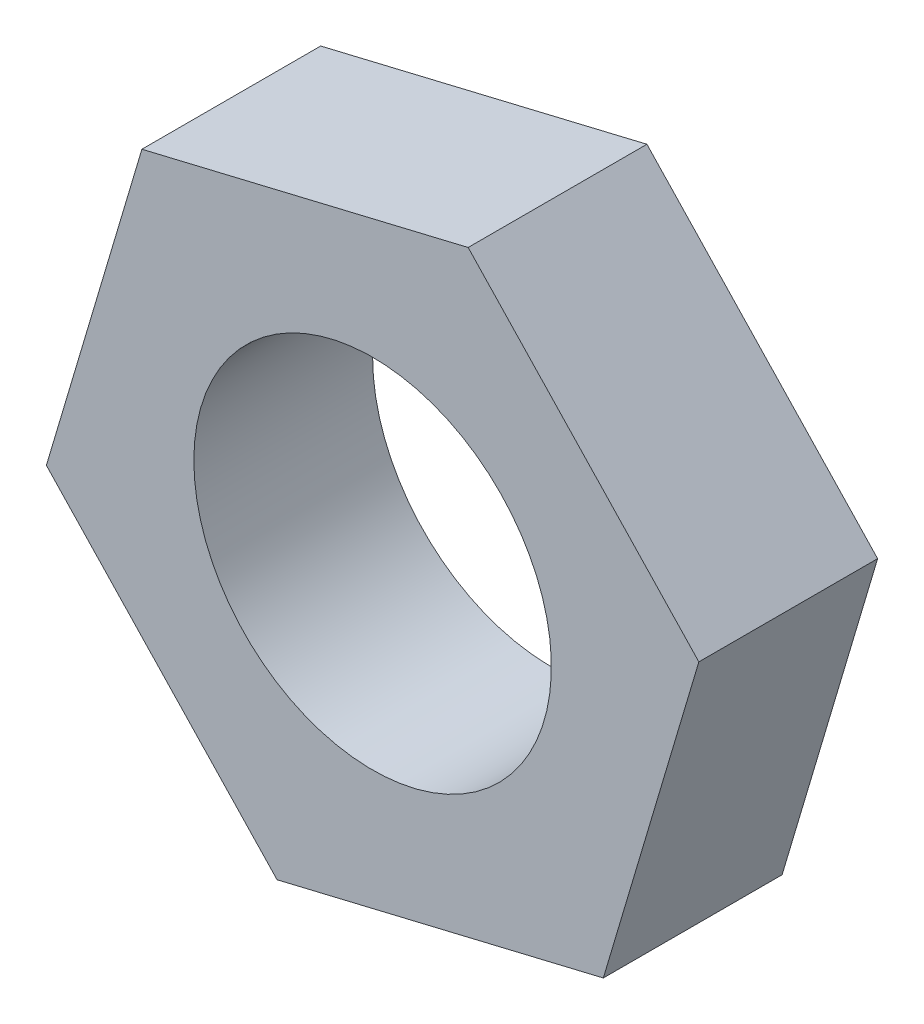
ISO-10303-21;
HEADER;
FILE_DESCRIPTION(('STEP AP214'),'2;1');
FILE_NAME('part.step','',(''),(''),'','','');
FILE_SCHEMA(('AUTOMOTIVE_DESIGN { 1 0 10303 214 1 1 1 1 }'));
ENDSEC;
DATA;
#1=APPLICATION_CONTEXT('core data for automotive mechanical design processes');
#2=APPLICATION_PROTOCOL_DEFINITION('international standard','automotive_design',2000,#1);
#3=PRODUCT_CONTEXT('',#1,'mechanical');
#4=PRODUCT('Part','Part','',(#3));
#5=PRODUCT_RELATED_PRODUCT_CATEGORY('part','',(#4));
#6=PRODUCT_DEFINITION_FORMATION('','',#4);
#7=PRODUCT_DEFINITION_CONTEXT('part definition',#1,'design');
#8=PRODUCT_DEFINITION('design','',#6,#7);
#9=PRODUCT_DEFINITION_SHAPE('','',#8);
#10=(LENGTH_UNIT() NAMED_UNIT(*) SI_UNIT(.MILLI.,.METRE.));
#11=(NAMED_UNIT(*) PLANE_ANGLE_UNIT() SI_UNIT($,.RADIAN.));
#12=(NAMED_UNIT(*) SI_UNIT($,.STERADIAN.) SOLID_ANGLE_UNIT());
#13=UNCERTAINTY_MEASURE_WITH_UNIT(LENGTH_MEASURE(1.E-05),#10,'distance_accuracy_value','');
#14=(GEOMETRIC_REPRESENTATION_CONTEXT(3) GLOBAL_UNCERTAINTY_ASSIGNED_CONTEXT((#13)) GLOBAL_UNIT_ASSIGNED_CONTEXT((#10,
#11,#12)) REPRESENTATION_CONTEXT('',''));
#15=CARTESIAN_POINT('',(0.,0.,0.));
#16=DIRECTION('',(0.,0.,1.));
#17=DIRECTION('',(1.,0.,0.));
#18=AXIS2_PLACEMENT_3D('',#15,#16,#17);
#19=CARTESIAN_POINT('',(0.,0.,0.));
#20=DIRECTION('',(0.,0.,1.));
#21=DIRECTION('',(1.,0.,0.));
#22=AXIS2_PLACEMENT_3D('',#19,#20,#21);
#23=PLANE('',#22);
#24=CARTESIAN_POINT('',(-24.6838750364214,9.40791708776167,0.));
#25=DIRECTION('',(0.,0.,-1.));
#26=DIRECTION('',(-1.,0.,0.));
#27=AXIS2_PLACEMENT_3D('',#24,#25,#26);
#28=CIRCLE('',#27,4.);
#29=CARTESIAN_POINT('',(-28.6838750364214,9.40791708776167,0.));
#30=VERTEX_POINT('',#29);
#31=EDGE_CURVE('E19',#30,#30,#28,.F.);
#32=ORIENTED_EDGE('',*,*,#31,.T.);
#33=EDGE_LOOP('',(#32));
#34=FACE_BOUND('',#33,.T.);
#35=DIRECTION('',(-0.687744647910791,0.72595268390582,0.));
#36=VECTOR('',#35,1.);
#37=CARTESIAN_POINT('',(-31.9835196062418,7.66191522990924,0.));
#38=LINE('',#37,#36);
#39=CARTESIAN_POINT('',(-26.8216153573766,2.21323852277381,0.));
#40=VERTEX_POINT('',#39);
#41=CARTESIAN_POINT('',(-31.9835196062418,7.66191522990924,0.));
#42=VERTEX_POINT('',#41);
#43=EDGE_CURVE('E104',#40,#42,#38,.T.);
#44=ORIENTED_EDGE('',*,*,#43,.T.);
#45=DIRECTION('',(0.284821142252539,0.958580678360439,0.));
#46=VECTOR('',#45,1.);
#47=CARTESIAN_POINT('',(-29.8457792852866,14.8565937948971,0.));
#48=LINE('',#47,#46);
#49=CARTESIAN_POINT('',(-29.8457792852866,14.8565937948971,0.));
#50=VERTEX_POINT('',#49);
#51=EDGE_CURVE('E99',#42,#50,#48,.T.);
#52=ORIENTED_EDGE('',*,*,#51,.T.);
#53=DIRECTION('',(0.97256579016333,0.232627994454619,0.));
#54=VECTOR('',#53,1.);
#55=CARTESIAN_POINT('',(-22.5461347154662,16.6025956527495,0.));
#56=LINE('',#55,#54);
#57=CARTESIAN_POINT('',(-22.5461347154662,16.6025956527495,0.));
#58=VERTEX_POINT('',#57);
#59=EDGE_CURVE('E95',#50,#58,#56,.T.);
#60=ORIENTED_EDGE('',*,*,#59,.T.);
#61=DIRECTION('',(0.687744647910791,-0.725952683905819,0.));
#62=VECTOR('',#61,1.);
#63=CARTESIAN_POINT('',(-17.3842304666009,11.1539189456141,0.));
#64=LINE('',#63,#62);
#65=CARTESIAN_POINT('',(-17.3842304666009,11.1539189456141,0.));
#66=VERTEX_POINT('',#65);
#67=EDGE_CURVE('E81',#58,#66,#64,.T.);
#68=ORIENTED_EDGE('',*,*,#67,.T.);
#69=DIRECTION('',(-0.28482114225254,-0.958580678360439,0.));
#70=VECTOR('',#69,1.);
#71=CARTESIAN_POINT('',(-19.5219707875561,3.95924038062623,0.));
#72=LINE('',#71,#70);
#73=CARTESIAN_POINT('',(-19.5219707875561,3.95924038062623,0.));
#74=VERTEX_POINT('',#73);
#75=EDGE_CURVE('E65',#66,#74,#72,.T.);
#76=ORIENTED_EDGE('',*,*,#75,.T.);
#77=DIRECTION('',(-0.97256579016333,-0.232627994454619,0.));
#78=VECTOR('',#77,1.);
#79=CARTESIAN_POINT('',(-26.8216153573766,2.21323852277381,0.));
#80=LINE('',#79,#78);
#81=EDGE_CURVE('E70',#74,#40,#80,.T.);
#82=ORIENTED_EDGE('',*,*,#81,.T.);
#83=EDGE_LOOP('',(#44,#52,#60,#68,#76,#82));
#84=FACE_BOUND('',#83,.T.);
#85=ADVANCED_FACE('F16',(#34,#84),#23,.F.);
#86=CARTESIAN_POINT('',(-26.8216153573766,2.21323852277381,4.));
#87=DIRECTION('',(-0.232627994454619,0.97256579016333,0.));
#88=DIRECTION('',(-0.97256579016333,-0.232627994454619,0.));
#89=AXIS2_PLACEMENT_3D('',#86,#87,#88);
#90=PLANE('',#89);
#91=DIRECTION('',(0.,0.,1.));
#92=VECTOR('',#91,1.);
#93=CARTESIAN_POINT('',(-19.5219707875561,3.95924038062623,4.));
#94=LINE('',#93,#92);
#95=CARTESIAN_POINT('',(-19.5219707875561,3.95924038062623,4.));
#96=VERTEX_POINT('',#95);
#97=EDGE_CURVE('E72',#74,#96,#94,.T.);
#98=ORIENTED_EDGE('',*,*,#97,.T.);
#99=DIRECTION('',(0.97256579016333,0.232627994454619,0.));
#100=VECTOR('',#99,1.);
#101=CARTESIAN_POINT('',(-26.8216153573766,2.21323852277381,4.));
#102=LINE('',#101,#100);
#103=CARTESIAN_POINT('',(-26.8216153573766,2.21323852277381,4.));
#104=VERTEX_POINT('',#103);
#105=EDGE_CURVE('E106',#104,#96,#102,.T.);
#106=ORIENTED_EDGE('',*,*,#105,.F.);
#107=DIRECTION('',(0.,0.,1.));
#108=VECTOR('',#107,1.);
#109=CARTESIAN_POINT('',(-26.8216153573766,2.21323852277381,4.));
#110=LINE('',#109,#108);
#111=EDGE_CURVE('E75',#104,#40,#110,.F.);
#112=ORIENTED_EDGE('',*,*,#111,.T.);
#113=ORIENTED_EDGE('',*,*,#81,.F.);
#114=EDGE_LOOP('',(#98,#106,#112,#113));
#115=FACE_BOUND('',#114,.T.);
#116=ADVANCED_FACE('F71',(#115),#90,.F.);
#117=CARTESIAN_POINT('',(-19.5219707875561,3.95924038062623,4.));
#118=DIRECTION('',(-0.958580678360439,0.28482114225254,0.));
#119=DIRECTION('',(-0.28482114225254,-0.958580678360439,0.));
#120=AXIS2_PLACEMENT_3D('',#117,#118,#119);
#121=PLANE('',#120);
#122=DIRECTION('',(0.,0.,1.));
#123=VECTOR('',#122,1.);
#124=CARTESIAN_POINT('',(-17.3842304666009,11.1539189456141,4.));
#125=LINE('',#124,#123);
#126=CARTESIAN_POINT('',(-17.3842304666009,11.1539189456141,4.));
#127=VERTEX_POINT('',#126);
#128=EDGE_CURVE('E83',#66,#127,#125,.T.);
#129=ORIENTED_EDGE('',*,*,#128,.T.);
#130=DIRECTION('',(0.284821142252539,0.958580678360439,0.));
#131=VECTOR('',#130,1.);
#132=CARTESIAN_POINT('',(-19.5219707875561,3.95924038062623,4.));
#133=LINE('',#132,#131);
#134=EDGE_CURVE('E87',#96,#127,#133,.T.);
#135=ORIENTED_EDGE('',*,*,#134,.F.);
#136=ORIENTED_EDGE('',*,*,#97,.F.);
#137=ORIENTED_EDGE('',*,*,#75,.F.);
#138=EDGE_LOOP('',(#129,#135,#136,#137));
#139=FACE_BOUND('',#138,.T.);
#140=ADVANCED_FACE('F85',(#139),#121,.F.);
#141=CARTESIAN_POINT('',(-17.3842304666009,11.1539189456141,4.));
#142=DIRECTION('',(-0.725952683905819,-0.687744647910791,0.));
#143=DIRECTION('',(0.687744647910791,-0.725952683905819,0.));
#144=AXIS2_PLACEMENT_3D('',#141,#142,#143);
#145=PLANE('',#144);
#146=DIRECTION('',(0.,0.,1.));
#147=VECTOR('',#146,1.);
#148=CARTESIAN_POINT('',(-22.5461347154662,16.6025956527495,4.));
#149=LINE('',#148,#147);
#150=CARTESIAN_POINT('',(-22.5461347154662,16.6025956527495,4.));
#151=VERTEX_POINT('',#150);
#152=EDGE_CURVE('E93',#58,#151,#149,.T.);
#153=ORIENTED_EDGE('',*,*,#152,.T.);
#154=DIRECTION('',(-0.687744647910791,0.725952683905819,0.));
#155=VECTOR('',#154,1.);
#156=CARTESIAN_POINT('',(-17.3842304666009,11.1539189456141,4.));
#157=LINE('',#156,#155);
#158=EDGE_CURVE('E109',#127,#151,#157,.T.);
#159=ORIENTED_EDGE('',*,*,#158,.F.);
#160=ORIENTED_EDGE('',*,*,#128,.F.);
#161=ORIENTED_EDGE('',*,*,#67,.F.);
#162=EDGE_LOOP('',(#153,#159,#160,#161));
#163=FACE_BOUND('',#162,.T.);
#164=ADVANCED_FACE('F131',(#163),#145,.F.);
#165=CARTESIAN_POINT('',(-22.5461347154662,16.6025956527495,4.));
#166=DIRECTION('',(0.232627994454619,-0.97256579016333,0.));
#167=DIRECTION('',(0.97256579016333,0.232627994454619,0.));
#168=AXIS2_PLACEMENT_3D('',#165,#166,#167);
#169=PLANE('',#168);
#170=DIRECTION('',(0.,0.,1.));
#171=VECTOR('',#170,1.);
#172=CARTESIAN_POINT('',(-29.8457792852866,14.8565937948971,4.));
#173=LINE('',#172,#171);
#174=CARTESIAN_POINT('',(-29.8457792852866,14.8565937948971,4.));
#175=VERTEX_POINT('',#174);
#176=EDGE_CURVE('E97',#50,#175,#173,.T.);
#177=ORIENTED_EDGE('',*,*,#176,.T.);
#178=DIRECTION('',(-0.97256579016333,-0.232627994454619,0.));
#179=VECTOR('',#178,1.);
#180=CARTESIAN_POINT('',(-22.5461347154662,16.6025956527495,4.));
#181=LINE('',#180,#179);
#182=EDGE_CURVE('E112',#151,#175,#181,.T.);
#183=ORIENTED_EDGE('',*,*,#182,.F.);
#184=ORIENTED_EDGE('',*,*,#152,.F.);
#185=ORIENTED_EDGE('',*,*,#59,.F.);
#186=EDGE_LOOP('',(#177,#183,#184,#185));
#187=FACE_BOUND('',#186,.T.);
#188=ADVANCED_FACE('F128',(#187),#169,.F.);
#189=CARTESIAN_POINT('',(-29.8457792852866,14.8565937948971,4.));
#190=DIRECTION('',(0.958580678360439,-0.284821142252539,0.));
#191=DIRECTION('',(0.284821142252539,0.958580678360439,0.));
#192=AXIS2_PLACEMENT_3D('',#189,#190,#191);
#193=PLANE('',#192);
#194=DIRECTION('',(0.,0.,1.));
#195=VECTOR('',#194,1.);
#196=CARTESIAN_POINT('',(-31.9835196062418,7.66191522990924,4.));
#197=LINE('',#196,#195);
#198=CARTESIAN_POINT('',(-31.9835196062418,7.66191522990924,4.));
#199=VERTEX_POINT('',#198);
#200=EDGE_CURVE('E33',#42,#199,#197,.T.);
#201=ORIENTED_EDGE('',*,*,#200,.T.);
#202=DIRECTION('',(-0.284821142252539,-0.958580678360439,0.));
#203=VECTOR('',#202,1.);
#204=CARTESIAN_POINT('',(-29.8457792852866,14.8565937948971,4.));
#205=LINE('',#204,#203);
#206=EDGE_CURVE('E115',#175,#199,#205,.T.);
#207=ORIENTED_EDGE('',*,*,#206,.F.);
#208=ORIENTED_EDGE('',*,*,#176,.F.);
#209=ORIENTED_EDGE('',*,*,#51,.F.);
#210=EDGE_LOOP('',(#201,#207,#208,#209));
#211=FACE_BOUND('',#210,.T.);
#212=ADVANCED_FACE('F125',(#211),#193,.F.);
#213=CARTESIAN_POINT('',(-31.9835196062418,7.66191522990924,4.));
#214=DIRECTION('',(0.72595268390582,0.687744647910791,0.));
#215=DIRECTION('',(-0.687744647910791,0.72595268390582,0.));
#216=AXIS2_PLACEMENT_3D('',#213,#214,#215);
#217=PLANE('',#216);
#218=ORIENTED_EDGE('',*,*,#111,.F.);
#219=DIRECTION('',(0.687744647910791,-0.725952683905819,0.));
#220=VECTOR('',#219,1.);
#221=CARTESIAN_POINT('',(-31.9835196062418,7.66191522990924,4.));
#222=LINE('',#221,#220);
#223=EDGE_CURVE('E25',#199,#104,#222,.T.);
#224=ORIENTED_EDGE('',*,*,#223,.F.);
#225=ORIENTED_EDGE('',*,*,#200,.F.);
#226=ORIENTED_EDGE('',*,*,#43,.F.);
#227=EDGE_LOOP('',(#218,#224,#225,#226));
#228=FACE_BOUND('',#227,.T.);
#229=ADVANCED_FACE('F122',(#228),#217,.F.);
#230=CARTESIAN_POINT('',(-24.6838750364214,9.40791708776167,4.));
#231=DIRECTION('',(0.,0.,-1.));
#232=DIRECTION('',(-1.,0.,0.));
#233=AXIS2_PLACEMENT_3D('',#230,#231,#232);
#234=CYLINDRICAL_SURFACE('',#233,4.);
#235=CARTESIAN_POINT('',(-24.6838750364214,9.40791708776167,4.));
#236=DIRECTION('',(0.,0.,-1.));
#237=DIRECTION('',(-1.,0.,0.));
#238=AXIS2_PLACEMENT_3D('',#235,#236,#237);
#239=CIRCLE('',#238,4.);
#240=CARTESIAN_POINT('',(-28.6838750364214,9.40791708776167,4.));
#241=VERTEX_POINT('',#240);
#242=EDGE_CURVE('E11',#241,#241,#239,.T.);
#243=ORIENTED_EDGE('',*,*,#242,.F.);
#244=EDGE_LOOP('',(#243));
#245=FACE_BOUND('',#244,.T.);
#246=ORIENTED_EDGE('',*,*,#31,.F.);
#247=EDGE_LOOP('',(#246));
#248=FACE_BOUND('',#247,.T.);
#249=ADVANCED_FACE('F142',(#245,#248),#234,.F.);
#250=CARTESIAN_POINT('',(0.,0.,4.));
#251=DIRECTION('',(0.,0.,1.));
#252=DIRECTION('',(1.,0.,0.));
#253=AXIS2_PLACEMENT_3D('',#250,#251,#252);
#254=PLANE('',#253);
#255=ORIENTED_EDGE('',*,*,#242,.T.);
#256=EDGE_LOOP('',(#255));
#257=FACE_BOUND('',#256,.T.);
#258=ORIENTED_EDGE('',*,*,#206,.T.);
#259=ORIENTED_EDGE('',*,*,#223,.T.);
#260=ORIENTED_EDGE('',*,*,#105,.T.);
#261=ORIENTED_EDGE('',*,*,#134,.T.);
#262=ORIENTED_EDGE('',*,*,#158,.T.);
#263=ORIENTED_EDGE('',*,*,#182,.T.);
#264=EDGE_LOOP('',(#258,#259,#260,#261,#262,#263));
#265=FACE_BOUND('',#264,.T.);
#266=ADVANCED_FACE('F120',(#257,#265),#254,.T.);
#267=CLOSED_SHELL('',(#85,#116,#140,#164,#188,#212,#229,#249,#266));
#268=MANIFOLD_SOLID_BREP('B1',#267);
#269=ADVANCED_BREP_SHAPE_REPRESENTATION('',(#18,#268),#14);
#270=SHAPE_DEFINITION_REPRESENTATION(#9,#269);
ENDSEC;
END-ISO-10303-21;
